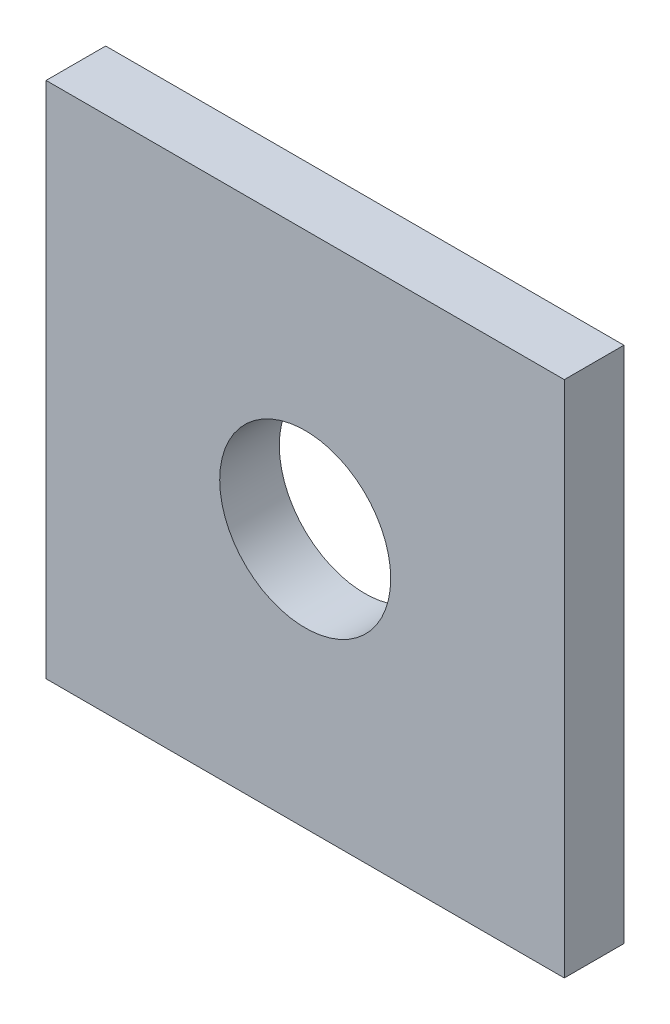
from build123d import *

# Parameters (mm, degrees)
BODYSKE_W      = 20
BODYSKE_H      = 20
BODYSKE_R      = 3.3
BASEBODY_DEPTH = 2.3


with BuildPart() as part:
    # BodySke → BaseBody (new body)
    with BuildSketch(Plane.XY):
        with Locations((0, 10)):
            Rectangle(BODYSKE_W, BODYSKE_H)
        with Locations((0, 10)):
            Circle(BODYSKE_R, mode=Mode.SUBTRACT)
    extrude(amount=BASEBODY_DEPTH)


solid = part.part
